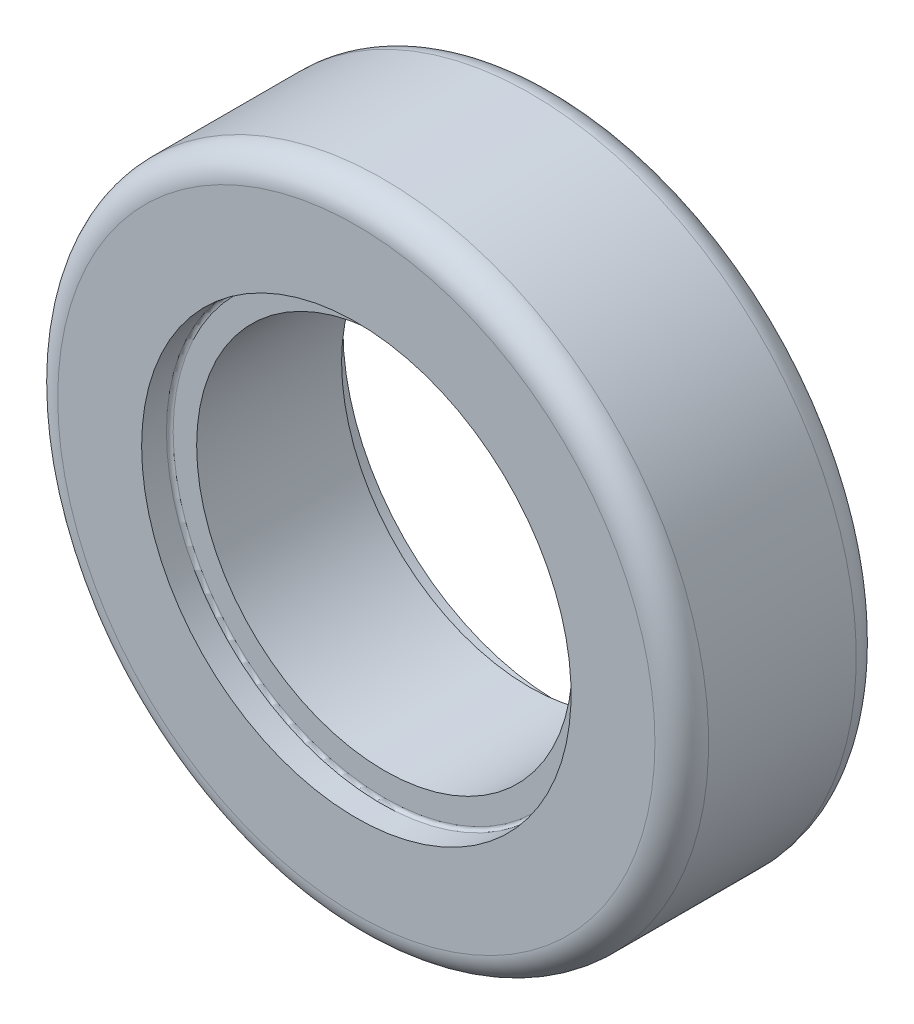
ISO-10303-21;
HEADER;
FILE_DESCRIPTION(('STEP AP214'),'2;1');
FILE_NAME('part.step','',(''),(''),'','','');
FILE_SCHEMA(('AUTOMOTIVE_DESIGN { 1 0 10303 214 1 1 1 1 }'));
ENDSEC;
DATA;
#1=APPLICATION_CONTEXT('core data for automotive mechanical design processes');
#2=APPLICATION_PROTOCOL_DEFINITION('international standard','automotive_design',2000,#1);
#3=PRODUCT_CONTEXT('',#1,'mechanical');
#4=PRODUCT('Part','Part','',(#3));
#5=PRODUCT_RELATED_PRODUCT_CATEGORY('part','',(#4));
#6=PRODUCT_DEFINITION_FORMATION('','',#4);
#7=PRODUCT_DEFINITION_CONTEXT('part definition',#1,'design');
#8=PRODUCT_DEFINITION('design','',#6,#7);
#9=PRODUCT_DEFINITION_SHAPE('','',#8);
#10=(LENGTH_UNIT() NAMED_UNIT(*) SI_UNIT(.MILLI.,.METRE.));
#11=(NAMED_UNIT(*) PLANE_ANGLE_UNIT() SI_UNIT($,.RADIAN.));
#12=(NAMED_UNIT(*) SI_UNIT($,.STERADIAN.) SOLID_ANGLE_UNIT());
#13=UNCERTAINTY_MEASURE_WITH_UNIT(LENGTH_MEASURE(1.E-05),#10,'distance_accuracy_value','');
#14=(GEOMETRIC_REPRESENTATION_CONTEXT(3) GLOBAL_UNCERTAINTY_ASSIGNED_CONTEXT((#13)) GLOBAL_UNIT_ASSIGNED_CONTEXT((#10,
#11,#12)) REPRESENTATION_CONTEXT('',''));
#15=CARTESIAN_POINT('',(0.,0.,0.));
#16=DIRECTION('',(0.,0.,1.));
#17=DIRECTION('',(1.,0.,0.));
#18=AXIS2_PLACEMENT_3D('',#15,#16,#17);
#19=CARTESIAN_POINT('',(0.,0.,-17.145));
#20=DIRECTION('',(0.,0.,-1.));
#21=DIRECTION('',(-1.,0.,0.));
#22=AXIS2_PLACEMENT_3D('',#19,#20,#21);
#23=CYLINDRICAL_SURFACE('',#22,44.45);
#24=CARTESIAN_POINT('',(0.,0.,-17.145));
#25=DIRECTION('',(0.,0.,-1.));
#26=DIRECTION('',(-1.,0.,0.));
#27=AXIS2_PLACEMENT_3D('',#24,#25,#26);
#28=CIRCLE('',#27,44.45);
#29=CARTESIAN_POINT('',(-44.45,0.,-17.145));
#30=VERTEX_POINT('',#29);
#31=EDGE_CURVE('E63',#30,#30,#28,.F.);
#32=ORIENTED_EDGE('',*,*,#31,.F.);
#33=EDGE_LOOP('',(#32));
#34=FACE_BOUND('',#33,.T.);
#35=CARTESIAN_POINT('',(0.,0.,17.145));
#36=DIRECTION('',(0.,0.,-1.));
#37=DIRECTION('',(-1.,0.,0.));
#38=AXIS2_PLACEMENT_3D('',#35,#36,#37);
#39=CIRCLE('',#38,44.45);
#40=CARTESIAN_POINT('',(-44.45,0.,17.145));
#41=VERTEX_POINT('',#40);
#42=EDGE_CURVE('E255',#41,#41,#39,.T.);
#43=ORIENTED_EDGE('',*,*,#42,.F.);
#44=EDGE_LOOP('',(#43));
#45=FACE_BOUND('',#44,.T.);
#46=ADVANCED_FACE('F16',(#34,#45),#23,.F.);
#47=CARTESIAN_POINT('',(-44.45,0.,17.145));
#48=DIRECTION('',(0.,0.,1.));
#49=DIRECTION('',(1.,0.,0.));
#50=AXIS2_PLACEMENT_3D('',#47,#48,#49);
#51=PLANE('',#50);
#52=ORIENTED_EDGE('',*,*,#42,.T.);
#53=EDGE_LOOP('',(#52));
#54=FACE_BOUND('',#53,.T.);
#55=CARTESIAN_POINT('',(0.,0.,17.145));
#56=DIRECTION('',(0.,0.,-1.));
#57=DIRECTION('',(-1.,0.,0.));
#58=AXIS2_PLACEMENT_3D('',#55,#56,#57);
#59=CIRCLE('',#58,50.00625);
#60=CARTESIAN_POINT('',(50.00625,0.,17.145));
#61=VERTEX_POINT('',#60);
#62=CARTESIAN_POINT('',(-50.00625,0.,17.145));
#63=VERTEX_POINT('',#62);
#64=EDGE_CURVE('E56',#61,#63,#59,.F.);
#65=ORIENTED_EDGE('',*,*,#64,.T.);
#66=CARTESIAN_POINT('',(0.,0.,17.145));
#67=DIRECTION('',(0.,0.,-1.));
#68=DIRECTION('',(1.,0.,0.));
#69=AXIS2_PLACEMENT_3D('',#66,#67,#68);
#70=CIRCLE('',#69,50.00625);
#71=EDGE_CURVE('E61',#63,#61,#70,.F.);
#72=ORIENTED_EDGE('',*,*,#71,.T.);
#73=EDGE_LOOP('',(#65,#72));
#74=FACE_BOUND('',#73,.T.);
#75=ADVANCED_FACE('F66',(#54,#74),#51,.T.);
#76=CARTESIAN_POINT('',(-50.8,0.,-17.145));
#77=DIRECTION('',(0.,0.,-1.));
#78=DIRECTION('',(-1.,0.,0.));
#79=AXIS2_PLACEMENT_3D('',#76,#77,#78);
#80=PLANE('',#79);
#81=ORIENTED_EDGE('',*,*,#31,.T.);
#82=EDGE_LOOP('',(#81));
#83=FACE_BOUND('',#82,.T.);
#84=CARTESIAN_POINT('',(0.,0.,-17.145));
#85=DIRECTION('',(0.,0.,1.));
#86=DIRECTION('',(1.,0.,0.));
#87=AXIS2_PLACEMENT_3D('',#84,#85,#86);
#88=CIRCLE('',#87,50.00625);
#89=CARTESIAN_POINT('',(-50.00625,0.,-17.145));
#90=VERTEX_POINT('',#89);
#91=CARTESIAN_POINT('',(50.00625,0.,-17.145));
#92=VERTEX_POINT('',#91);
#93=EDGE_CURVE('E67',#90,#92,#88,.F.);
#94=ORIENTED_EDGE('',*,*,#93,.T.);
#95=CARTESIAN_POINT('',(0.,0.,-17.145));
#96=DIRECTION('',(0.,0.,1.));
#97=DIRECTION('',(-1.,0.,0.));
#98=AXIS2_PLACEMENT_3D('',#95,#96,#97);
#99=CIRCLE('',#98,50.00625);
#100=EDGE_CURVE('E111',#92,#90,#99,.F.);
#101=ORIENTED_EDGE('',*,*,#100,.T.);
#102=EDGE_LOOP('',(#94,#101));
#103=FACE_BOUND('',#102,.T.);
#104=ADVANCED_FACE('F83',(#83,#103),#80,.T.);
#105=CARTESIAN_POINT('',(0.,0.,17.93875));
#106=DIRECTION('',(0.,0.,1.));
#107=DIRECTION('',(1.,0.,0.));
#108=AXIS2_PLACEMENT_3D('',#105,#106,#107);
#109=TOROIDAL_SURFACE('',#108,50.00625,0.79375);
#110=CARTESIAN_POINT('',(0.,0.,17.93875));
#111=DIRECTION('',(0.,0.,-1.));
#112=DIRECTION('',(-1.,0.,0.));
#113=AXIS2_PLACEMENT_3D('',#110,#111,#112);
#114=CIRCLE('',#113,50.8);
#115=CARTESIAN_POINT('',(-50.8,0.,17.93875));
#116=VERTEX_POINT('',#115);
#117=EDGE_CURVE('E136',#116,#116,#114,.F.);
#118=ORIENTED_EDGE('',*,*,#117,.T.);
#119=EDGE_LOOP('',(#118));
#120=FACE_BOUND('',#119,.T.);
#121=ORIENTED_EDGE('',*,*,#71,.F.);
#122=ORIENTED_EDGE('',*,*,#64,.F.);
#123=EDGE_LOOP('',(#121,#122));
#124=FACE_BOUND('',#123,.T.);
#125=ADVANCED_FACE('F60',(#120,#124),#109,.F.);
#126=CARTESIAN_POINT('',(0.,0.,-17.93875));
#127=DIRECTION('',(0.,0.,-1.));
#128=DIRECTION('',(-1.,0.,0.));
#129=AXIS2_PLACEMENT_3D('',#126,#127,#128);
#130=TOROIDAL_SURFACE('',#129,50.00625,0.79375);
#131=CARTESIAN_POINT('',(0.,0.,-17.93875));
#132=DIRECTION('',(0.,0.,-1.));
#133=DIRECTION('',(-1.,0.,0.));
#134=AXIS2_PLACEMENT_3D('',#131,#132,#133);
#135=CIRCLE('',#134,50.8);
#136=CARTESIAN_POINT('',(-50.8,0.,-17.93875));
#137=VERTEX_POINT('',#136);
#138=EDGE_CURVE('E132',#137,#137,#135,.T.);
#139=ORIENTED_EDGE('',*,*,#138,.T.);
#140=EDGE_LOOP('',(#139));
#141=FACE_BOUND('',#140,.T.);
#142=ORIENTED_EDGE('',*,*,#100,.F.);
#143=ORIENTED_EDGE('',*,*,#93,.F.);
#144=EDGE_LOOP('',(#142,#143));
#145=FACE_BOUND('',#144,.T.);
#146=ADVANCED_FACE('F114',(#141,#145),#130,.F.);
#147=CARTESIAN_POINT('',(0.,0.,-17.145));
#148=DIRECTION('',(0.,0.,-1.));
#149=DIRECTION('',(-1.,0.,0.));
#150=AXIS2_PLACEMENT_3D('',#147,#148,#149);
#151=CYLINDRICAL_SURFACE('',#150,50.8);
#152=ORIENTED_EDGE('',*,*,#117,.F.);
#153=EDGE_LOOP('',(#152));
#154=FACE_BOUND('',#153,.T.);
#155=CARTESIAN_POINT('',(0.,0.,23.8125));
#156=DIRECTION('',(0.,0.,-1.));
#157=DIRECTION('',(-1.,0.,0.));
#158=AXIS2_PLACEMENT_3D('',#155,#156,#157);
#159=CIRCLE('',#158,50.8);
#160=CARTESIAN_POINT('',(-50.8,0.,23.8125));
#161=VERTEX_POINT('',#160);
#162=EDGE_CURVE('E135',#161,#161,#159,.T.);
#163=ORIENTED_EDGE('',*,*,#162,.F.);
#164=EDGE_LOOP('',(#163));
#165=FACE_BOUND('',#164,.T.);
#166=ADVANCED_FACE('F124',(#154,#165),#151,.F.);
#167=CARTESIAN_POINT('',(0.,0.,-17.145));
#168=DIRECTION('',(0.,0.,-1.));
#169=DIRECTION('',(-1.,0.,0.));
#170=AXIS2_PLACEMENT_3D('',#167,#168,#169);
#171=CYLINDRICAL_SURFACE('',#170,50.8);
#172=CARTESIAN_POINT('',(0.,0.,-23.8125));
#173=DIRECTION('',(0.,0.,-1.));
#174=DIRECTION('',(-1.,0.,0.));
#175=AXIS2_PLACEMENT_3D('',#172,#173,#174);
#176=CIRCLE('',#175,50.8);
#177=CARTESIAN_POINT('',(-50.8,0.,-23.8125));
#178=VERTEX_POINT('',#177);
#179=EDGE_CURVE('E243',#178,#178,#176,.F.);
#180=ORIENTED_EDGE('',*,*,#179,.F.);
#181=EDGE_LOOP('',(#180));
#182=FACE_BOUND('',#181,.T.);
#183=ORIENTED_EDGE('',*,*,#138,.F.);
#184=EDGE_LOOP('',(#183));
#185=FACE_BOUND('',#184,.T.);
#186=ADVANCED_FACE('F222',(#182,#185),#171,.F.);
#187=CARTESIAN_POINT('',(-50.8,0.,23.8125));
#188=DIRECTION('',(0.,0.,1.));
#189=DIRECTION('',(1.,0.,0.));
#190=AXIS2_PLACEMENT_3D('',#187,#188,#189);
#191=PLANE('',#190);
#192=ORIENTED_EDGE('',*,*,#162,.T.);
#193=EDGE_LOOP('',(#192));
#194=FACE_BOUND('',#193,.T.);
#195=CARTESIAN_POINT('',(0.,0.,23.8125));
#196=DIRECTION('',(0.,0.,-1.));
#197=DIRECTION('',(-1.,0.,0.));
#198=AXIS2_PLACEMENT_3D('',#195,#196,#197);
#199=CIRCLE('',#198,70.64375);
#200=CARTESIAN_POINT('',(-70.64375,0.,23.8125));
#201=VERTEX_POINT('',#200);
#202=CARTESIAN_POINT('',(70.64375,0.,23.8125));
#203=VERTEX_POINT('',#202);
#204=EDGE_CURVE('E209',#201,#203,#199,.T.);
#205=ORIENTED_EDGE('',*,*,#204,.F.);
#206=CARTESIAN_POINT('',(0.,0.,23.8125));
#207=DIRECTION('',(0.,0.,-1.));
#208=DIRECTION('',(1.,0.,0.));
#209=AXIS2_PLACEMENT_3D('',#206,#207,#208);
#210=CIRCLE('',#209,70.64375);
#211=EDGE_CURVE('E241',#203,#201,#210,.T.);
#212=ORIENTED_EDGE('',*,*,#211,.F.);
#213=EDGE_LOOP('',(#205,#212));
#214=FACE_BOUND('',#213,.T.);
#215=ADVANCED_FACE('F214',(#194,#214),#191,.T.);
#216=CARTESIAN_POINT('',(-76.99375,0.,-23.8125));
#217=DIRECTION('',(0.,0.,-1.));
#218=DIRECTION('',(-1.,0.,0.));
#219=AXIS2_PLACEMENT_3D('',#216,#217,#218);
#220=PLANE('',#219);
#221=ORIENTED_EDGE('',*,*,#179,.T.);
#222=EDGE_LOOP('',(#221));
#223=FACE_BOUND('',#222,.T.);
#224=CARTESIAN_POINT('',(0.,0.,-23.8125));
#225=DIRECTION('',(0.,0.,1.));
#226=DIRECTION('',(1.,0.,0.));
#227=AXIS2_PLACEMENT_3D('',#224,#225,#226);
#228=CIRCLE('',#227,70.64375);
#229=CARTESIAN_POINT('',(70.64375,0.,-23.8125));
#230=VERTEX_POINT('',#229);
#231=CARTESIAN_POINT('',(-70.64375,0.,-23.8125));
#232=VERTEX_POINT('',#231);
#233=EDGE_CURVE('E178',#230,#232,#228,.T.);
#234=ORIENTED_EDGE('',*,*,#233,.F.);
#235=CARTESIAN_POINT('',(0.,0.,-23.8125));
#236=DIRECTION('',(0.,0.,1.));
#237=DIRECTION('',(-1.,0.,0.));
#238=AXIS2_PLACEMENT_3D('',#235,#236,#237);
#239=CIRCLE('',#238,70.64375);
#240=EDGE_CURVE('E35',#232,#230,#239,.T.);
#241=ORIENTED_EDGE('',*,*,#240,.F.);
#242=EDGE_LOOP('',(#234,#241));
#243=FACE_BOUND('',#242,.T.);
#244=ADVANCED_FACE('F166',(#223,#243),#220,.T.);
#245=CARTESIAN_POINT('',(0.,0.,17.4625));
#246=DIRECTION('',(0.,0.,1.));
#247=DIRECTION('',(1.,0.,0.));
#248=AXIS2_PLACEMENT_3D('',#245,#246,#247);
#249=TOROIDAL_SURFACE('',#248,70.64375,6.35);
#250=ORIENTED_EDGE('',*,*,#211,.T.);
#251=ORIENTED_EDGE('',*,*,#204,.T.);
#252=EDGE_LOOP('',(#250,#251));
#253=FACE_BOUND('',#252,.T.);
#254=CARTESIAN_POINT('',(0.,0.,17.4625));
#255=DIRECTION('',(0.,0.,-1.));
#256=DIRECTION('',(-1.,0.,0.));
#257=AXIS2_PLACEMENT_3D('',#254,#255,#256);
#258=CIRCLE('',#257,76.99375);
#259=CARTESIAN_POINT('',(-76.99375,0.,17.4625));
#260=VERTEX_POINT('',#259);
#261=EDGE_CURVE('E27',#260,#260,#258,.T.);
#262=ORIENTED_EDGE('',*,*,#261,.F.);
#263=EDGE_LOOP('',(#262));
#264=FACE_BOUND('',#263,.T.);
#265=ADVANCED_FACE('F154',(#253,#264),#249,.T.);
#266=CARTESIAN_POINT('',(0.,0.,-17.4625));
#267=DIRECTION('',(0.,0.,-1.));
#268=DIRECTION('',(-1.,0.,0.));
#269=AXIS2_PLACEMENT_3D('',#266,#267,#268);
#270=TOROIDAL_SURFACE('',#269,70.64375,6.35);
#271=ORIENTED_EDGE('',*,*,#240,.T.);
#272=ORIENTED_EDGE('',*,*,#233,.T.);
#273=EDGE_LOOP('',(#271,#272));
#274=FACE_BOUND('',#273,.T.);
#275=CARTESIAN_POINT('',(0.,0.,-17.4625));
#276=DIRECTION('',(0.,0.,-1.));
#277=DIRECTION('',(-1.,0.,0.));
#278=AXIS2_PLACEMENT_3D('',#275,#276,#277);
#279=CIRCLE('',#278,76.99375);
#280=CARTESIAN_POINT('',(-76.99375,0.,-17.4625));
#281=VERTEX_POINT('',#280);
#282=EDGE_CURVE('E11',#281,#281,#279,.F.);
#283=ORIENTED_EDGE('',*,*,#282,.F.);
#284=EDGE_LOOP('',(#283));
#285=FACE_BOUND('',#284,.T.);
#286=ADVANCED_FACE('F165',(#274,#285),#270,.T.);
#287=CARTESIAN_POINT('',(0.,0.,-17.145));
#288=DIRECTION('',(0.,0.,-1.));
#289=DIRECTION('',(-1.,0.,0.));
#290=AXIS2_PLACEMENT_3D('',#287,#288,#289);
#291=CYLINDRICAL_SURFACE('',#290,76.99375);
#292=ORIENTED_EDGE('',*,*,#282,.T.);
#293=EDGE_LOOP('',(#292));
#294=FACE_BOUND('',#293,.T.);
#295=ORIENTED_EDGE('',*,*,#261,.T.);
#296=EDGE_LOOP('',(#295));
#297=FACE_BOUND('',#296,.T.);
#298=ADVANCED_FACE('F272',(#294,#297),#291,.T.);
#299=CLOSED_SHELL('',(#46,#75,#104,#125,#146,#166,#186,#215,#244,#265,#286,#298));
#300=MANIFOLD_SOLID_BREP('B1',#299);
#301=ADVANCED_BREP_SHAPE_REPRESENTATION('',(#18,#300),#14);
#302=SHAPE_DEFINITION_REPRESENTATION(#9,#301);
ENDSEC;
END-ISO-10303-21;
